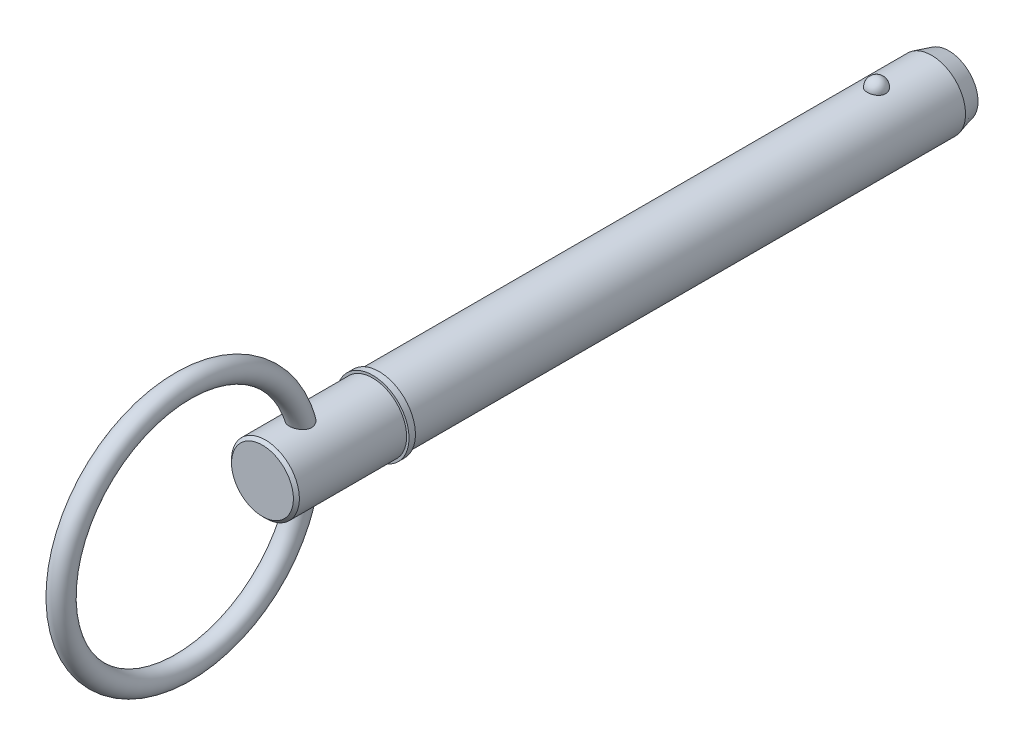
ISO-10303-21;
HEADER;
FILE_DESCRIPTION(('STEP AP214'),'2;1');
FILE_NAME('part.step','',(''),(''),'','','');
FILE_SCHEMA(('AUTOMOTIVE_DESIGN { 1 0 10303 214 1 1 1 1 }'));
ENDSEC;
DATA;
#1=APPLICATION_CONTEXT('core data for automotive mechanical design processes');
#2=APPLICATION_PROTOCOL_DEFINITION('international standard','automotive_design',2000,#1);
#3=PRODUCT_CONTEXT('',#1,'mechanical');
#4=PRODUCT('Part','Part','',(#3));
#5=PRODUCT_RELATED_PRODUCT_CATEGORY('part','',(#4));
#6=PRODUCT_DEFINITION_FORMATION('','',#4);
#7=PRODUCT_DEFINITION_CONTEXT('part definition',#1,'design');
#8=PRODUCT_DEFINITION('design','',#6,#7);
#9=PRODUCT_DEFINITION_SHAPE('','',#8);
#10=(LENGTH_UNIT() NAMED_UNIT(*) SI_UNIT(.MILLI.,.METRE.));
#11=(NAMED_UNIT(*) PLANE_ANGLE_UNIT() SI_UNIT($,.RADIAN.));
#12=(NAMED_UNIT(*) SI_UNIT($,.STERADIAN.) SOLID_ANGLE_UNIT());
#13=UNCERTAINTY_MEASURE_WITH_UNIT(LENGTH_MEASURE(1.E-05),#10,'distance_accuracy_value','');
#14=(GEOMETRIC_REPRESENTATION_CONTEXT(3) GLOBAL_UNCERTAINTY_ASSIGNED_CONTEXT((#13)) GLOBAL_UNIT_ASSIGNED_CONTEXT((#10,
#11,#12)) REPRESENTATION_CONTEXT('',''));
#15=CARTESIAN_POINT('',(0.,0.,0.));
#16=DIRECTION('',(0.,0.,1.));
#17=DIRECTION('',(1.,0.,0.));
#18=AXIS2_PLACEMENT_3D('',#15,#16,#17);
#19=CARTESIAN_POINT('',(0.,0.,114.3));
#20=DIRECTION('',(0.,0.,-1.));
#21=DIRECTION('',(-1.,0.,0.));
#22=AXIS2_PLACEMENT_3D('',#19,#20,#21);
#23=CYLINDRICAL_SURFACE('',#22,7.94);
#24=CARTESIAN_POINT('',(2.13020349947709,7.64891057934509,-2.14999999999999));
#25=CARTESIAN_POINT('',(2.1302012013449,7.64891247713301,-2.02978166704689));
#26=CARTESIAN_POINT('',(2.12037546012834,7.65166842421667,-1.90953383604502));
#27=CARTESIAN_POINT('',(2.08130792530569,7.66238579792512,-1.67243962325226));
#28=CARTESIAN_POINT('',(2.05205785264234,7.67034944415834,-1.55559471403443));
#29=CARTESIAN_POINT('',(1.97489181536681,7.69057749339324,-1.32869361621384));
#30=CARTESIAN_POINT('',(1.92698409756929,7.70283999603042,-1.21863445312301));
#31=CARTESIAN_POINT('',(1.81370645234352,7.73029430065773,-1.00831338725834));
#32=CARTESIAN_POINT('',(1.74833715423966,7.7454859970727,-0.908051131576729));
#33=CARTESIAN_POINT('',(1.60144242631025,7.77718699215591,-0.719628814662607));
#34=CARTESIAN_POINT('',(1.51984382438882,7.7937020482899,-0.631526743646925));
#35=CARTESIAN_POINT('',(1.34279837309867,7.82614685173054,-0.470411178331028));
#36=CARTESIAN_POINT('',(1.24735148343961,7.84207659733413,-0.397397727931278));
#37=CARTESIAN_POINT('',(1.04544839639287,7.87153116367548,-0.268681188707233));
#38=CARTESIAN_POINT('',(0.939022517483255,7.88506234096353,-0.212932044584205));
#39=CARTESIAN_POINT('',(0.717931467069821,7.90825597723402,-0.120080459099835));
#40=CARTESIAN_POINT('',(0.603267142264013,7.9179188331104,-0.0829761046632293));
#41=CARTESIAN_POINT('',(0.371015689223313,7.93216561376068,-0.0289596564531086));
#42=CARTESIAN_POINT('',(0.253510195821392,7.93683225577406,-0.0117183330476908));
#43=CARTESIAN_POINT('',(0.0171784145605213,7.94086051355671,0.00318921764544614));
#44=CARTESIAN_POINT('',(-0.101647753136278,7.94022260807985,0.000857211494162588));
#45=CARTESIAN_POINT('',(-0.335567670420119,7.93375751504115,-0.023146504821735));
#46=CARTESIAN_POINT('',(-0.450690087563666,7.92799987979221,-0.0445590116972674));
#47=CARTESIAN_POINT('',(-0.675610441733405,7.91200792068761,-0.10576054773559));
#48=CARTESIAN_POINT('',(-0.785408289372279,7.90177352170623,-0.145549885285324));
#49=CARTESIAN_POINT('',(-0.9972706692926,7.87784802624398,-0.242675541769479));
#50=CARTESIAN_POINT('',(-1.0992893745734,7.86413823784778,-0.300107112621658));
#51=CARTESIAN_POINT('',(-1.29223659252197,7.83474718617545,-0.430887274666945));
#52=CARTESIAN_POINT('',(-1.38316404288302,7.81906573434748,-0.504237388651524));
#53=CARTESIAN_POINT('',(-1.55313516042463,7.78710451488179,-0.666358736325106));
#54=CARTESIAN_POINT('',(-1.63193689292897,7.77081906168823,-0.755382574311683));
#55=CARTESIAN_POINT('',(-1.77366356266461,7.73970270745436,-0.945507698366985));
#56=CARTESIAN_POINT('',(-1.83658745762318,7.72487190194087,-1.04660977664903));
#57=CARTESIAN_POINT('',(-1.94556640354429,7.6981535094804,-1.25927689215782));
#58=CARTESIAN_POINT('',(-1.99143480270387,7.6862989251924,-1.3709418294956));
#59=CARTESIAN_POINT('',(-2.06418311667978,7.66708387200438,-1.60066153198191));
#60=CARTESIAN_POINT('',(-2.0910635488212,7.65972328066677,-1.71871612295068));
#61=CARTESIAN_POINT('',(-2.12508507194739,7.65035479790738,-1.9573607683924));
#62=CARTESIAN_POINT('',(-2.13230490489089,7.64832555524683,-2.07793875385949));
#63=CARTESIAN_POINT('',(-2.12704767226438,7.64978921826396,-2.31862835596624));
#64=CARTESIAN_POINT('',(-2.1145710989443,7.6532819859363,-2.43873998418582));
#65=CARTESIAN_POINT('',(-2.07034166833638,7.66536368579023,-2.67451689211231));
#66=CARTESIAN_POINT('',(-2.03867758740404,7.67392914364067,-2.79020005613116));
#67=CARTESIAN_POINT('',(-1.95694065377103,7.69517736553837,-3.01446692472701));
#68=CARTESIAN_POINT('',(-1.90686710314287,7.70786028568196,-3.12305035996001));
#69=CARTESIAN_POINT('',(-1.78925555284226,7.73600831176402,-3.33065971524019));
#70=CARTESIAN_POINT('',(-1.72162904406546,7.75148739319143,-3.42963360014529));
#71=CARTESIAN_POINT('',(-1.57074739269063,7.78346215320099,-3.61466914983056));
#72=CARTESIAN_POINT('',(-1.48749169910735,7.79995786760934,-3.70073035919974));
#73=CARTESIAN_POINT('',(-1.30720250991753,7.83219119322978,-3.8578359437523));
#74=CARTESIAN_POINT('',(-1.2101234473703,7.84792605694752,-3.92882863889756));
#75=CARTESIAN_POINT('',(-1.00503150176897,7.87681523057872,-4.05342383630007));
#76=CARTESIAN_POINT('',(-0.897019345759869,7.88996971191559,-4.10702749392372));
#77=CARTESIAN_POINT('',(-0.674439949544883,7.91208451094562,-4.19477736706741));
#78=CARTESIAN_POINT('',(-0.55996501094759,7.92109245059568,-4.22914554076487));
#79=CARTESIAN_POINT('',(-0.326625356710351,7.93413878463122,-4.27838865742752));
#80=CARTESIAN_POINT('',(-0.20776113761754,7.93817773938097,-4.29326579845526));
#81=CARTESIAN_POINT('',(0.0287357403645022,7.94081322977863,-4.3030062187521));
#82=CARTESIAN_POINT('',(0.14635312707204,7.93950453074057,-4.29821797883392));
#83=CARTESIAN_POINT('',(0.379062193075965,7.93180098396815,-4.26955229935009));
#84=CARTESIAN_POINT('',(0.494153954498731,7.92540630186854,-4.24567548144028));
#85=CARTESIAN_POINT('',(0.718185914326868,7.90824874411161,-4.17962260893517));
#86=CARTESIAN_POINT('',(0.827145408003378,7.89750055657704,-4.13750805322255));
#87=CARTESIAN_POINT('',(1.03638036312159,7.87277755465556,-4.03615078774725));
#88=CARTESIAN_POINT('',(1.13665531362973,7.85880255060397,-3.97690707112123));
#89=CARTESIAN_POINT('',(1.32729731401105,7.82887859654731,-3.84189297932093));
#90=CARTESIAN_POINT('',(1.41749828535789,7.81290379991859,-3.76589388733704));
#91=CARTESIAN_POINT('',(1.58397257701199,7.78086330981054,-3.59992466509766));
#92=CARTESIAN_POINT('',(1.66024342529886,7.76479760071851,-3.50995206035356));
#93=CARTESIAN_POINT('',(1.79805631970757,7.73405928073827,-3.3168832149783));
#94=CARTESIAN_POINT('',(1.85933944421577,7.719413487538,-3.213597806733));
#95=CARTESIAN_POINT('',(1.96397499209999,7.69345992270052,-2.99796163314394));
#96=CARTESIAN_POINT('',(2.00733488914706,7.68215076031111,-2.88561466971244));
#97=CARTESIAN_POINT('',(2.07068045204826,7.66529896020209,-2.6699413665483));
#98=CARTESIAN_POINT('',(2.09296296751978,7.65919990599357,-2.56732606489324));
#99=CARTESIAN_POINT('',(2.12272535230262,7.65100492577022,-2.35981463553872));
#100=CARTESIAN_POINT('',(2.13020550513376,7.64890892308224,-2.25491855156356));
#101=CARTESIAN_POINT('',(2.13020349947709,7.64891057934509,-2.14999999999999));
#102=B_SPLINE_CURVE_WITH_KNOTS('',3,(#24,#25,#26,#27,#28,#29,#30,#31,#32,#33,#34,#35,#36,#37,
#38,#39,#40,#41,#42,#43,#44,#45,#46,#47,#48,#49,#50,#51,#52,#53,#54,#55,#56,#57,#58,#59,#60,#61,
#62,#63,#64,#65,#66,#67,#68,#69,#70,#71,#72,#73,#74,#75,#76,#77,#78,#79,#80,#81,#82,#83,#84,#85,
#86,#87,#88,#89,#90,#91,#92,#93,#94,#95,#96,#97,#98,#99,#100,#101),.UNSPECIFIED.,.T.,.F.,(4,2,2,
2,2,2,2,2,2,2,2,2,2,2,2,2,2,2,2,2,2,2,2,2,2,2,2,2,2,2,2,2,2,2,2,2,2,2,4),(0.,0.360277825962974,
0.720709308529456,1.0809816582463,1.44124102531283,1.80316307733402,2.16508618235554,
2.52603531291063,2.88694740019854,3.24178717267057,3.59659491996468,3.94665496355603,
4.29672088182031,4.64871108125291,5.0007349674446,5.3590619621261,5.71741247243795,
6.079576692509,6.44173104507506,6.80243279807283,7.16312553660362,7.52216203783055,
7.88121215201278,8.24210915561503,8.60301888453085,8.96514709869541,9.32725124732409,
9.68508606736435,10.0428805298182,10.3943622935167,10.7458326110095,11.0961268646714,
11.4464417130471,11.8018724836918,12.1573662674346,12.5186252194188,12.8797333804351,
13.1941658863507,13.5085923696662),.UNSPECIFIED.);
#103=CARTESIAN_POINT('',(2.13020349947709,7.64891057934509,-2.14999999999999));
#104=VERTEX_POINT('',#103);
#105=EDGE_CURVE('E102',#104,#104,#102,.T.);
#106=ORIENTED_EDGE('',*,*,#105,.T.);
#107=EDGE_LOOP('',(#106));
#108=FACE_BOUND('',#107,.T.);
#109=CARTESIAN_POINT('',(0.,0.,-15.0499999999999));
#110=DIRECTION('',(0.,0.,-1.));
#111=DIRECTION('',(-1.,0.,0.));
#112=AXIS2_PLACEMENT_3D('',#109,#110,#111);
#113=CIRCLE('',#112,7.94);
#114=CARTESIAN_POINT('',(-7.94,0.,-15.0499999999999));
#115=VERTEX_POINT('',#114);
#116=EDGE_CURVE('E110',#115,#115,#113,.F.);
#117=ORIENTED_EDGE('',*,*,#116,.T.);
#118=EDGE_LOOP('',(#117));
#119=FACE_BOUND('',#118,.T.);
#120=CARTESIAN_POINT('',(0.,0.,114.3));
#121=DIRECTION('',(0.,0.,1.));
#122=DIRECTION('',(1.,0.,0.));
#123=AXIS2_PLACEMENT_3D('',#120,#121,#122);
#124=CIRCLE('',#123,7.94);
#125=CARTESIAN_POINT('',(7.94,0.,114.3));
#126=VERTEX_POINT('',#125);
#127=EDGE_CURVE('E108',#126,#126,#124,.T.);
#128=ORIENTED_EDGE('',*,*,#127,.F.);
#129=EDGE_LOOP('',(#128));
#130=FACE_BOUND('',#129,.T.);
#131=ADVANCED_FACE('F39',(#108,#119,#130),#23,.T.);
#132=CARTESIAN_POINT('',(0.,0.,-19.05));
#133=DIRECTION('',(0.,0.,-1.));
#134=DIRECTION('',(-1.,0.,0.));
#135=AXIS2_PLACEMENT_3D('',#132,#133,#134);
#136=PLANE('',#135);
#137=CARTESIAN_POINT('',(0.,0.,-19.05));
#138=DIRECTION('',(0.,0.,-1.));
#139=DIRECTION('',(-1.,0.,0.));
#140=AXIS2_PLACEMENT_3D('',#137,#138,#139);
#141=CIRCLE('',#140,6.86820323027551);
#142=CARTESIAN_POINT('',(-6.86820323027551,0.,-19.05));
#143=VERTEX_POINT('',#142);
#144=EDGE_CURVE('E143',#143,#143,#141,.T.);
#145=ORIENTED_EDGE('',*,*,#144,.T.);
#146=EDGE_LOOP('',(#145));
#147=FACE_BOUND('',#146,.T.);
#148=ADVANCED_FACE('F88',(#147),#136,.T.);
#149=CARTESIAN_POINT('',(0.,0.,-19.05));
#150=DIRECTION('',(0.,0.,1.));
#151=DIRECTION('',(1.,0.,0.));
#152=AXIS2_PLACEMENT_3D('',#149,#150,#151);
#153=CONICAL_SURFACE('',#152,6.86820323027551,0.261799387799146);
#154=ORIENTED_EDGE('',*,*,#116,.F.);
#155=EDGE_LOOP('',(#154));
#156=FACE_BOUND('',#155,.T.);
#157=ORIENTED_EDGE('',*,*,#144,.F.);
#158=EDGE_LOOP('',(#157));
#159=FACE_BOUND('',#158,.T.);
#160=ADVANCED_FACE('F94',(#156,#159),#153,.T.);
#161=CARTESIAN_POINT('',(0.,7.94,-2.14999999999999));
#162=DIRECTION('',(0.,1.,0.));
#163=DIRECTION('',(0.,0.,1.));
#164=AXIS2_PLACEMENT_3D('',#161,#162,#163);
#165=SPHERICAL_SURFACE('',#164,2.15);
#166=ORIENTED_EDGE('',*,*,#105,.F.);
#167=EDGE_LOOP('',(#166));
#168=FACE_BOUND('',#167,.T.);
#169=ADVANCED_FACE('F113',(#168),#165,.T.);
#170=CARTESIAN_POINT('',(0.,0.,114.3));
#171=DIRECTION('',(0.,0.,-1.));
#172=DIRECTION('',(-1.,0.,0.));
#173=AXIS2_PLACEMENT_3D('',#170,#171,#172);
#174=PLANE('',#173);
#175=ORIENTED_EDGE('',*,*,#127,.T.);
#176=EDGE_LOOP('',(#175));
#177=FACE_BOUND('',#176,.T.);
#178=CARTESIAN_POINT('',(0.,0.,114.3));
#179=DIRECTION('',(0.,0.,-1.));
#180=DIRECTION('',(-1.,0.,0.));
#181=AXIS2_PLACEMENT_3D('',#178,#179,#180);
#182=CIRCLE('',#181,8.5);
#183=CARTESIAN_POINT('',(-8.5,0.,114.3));
#184=VERTEX_POINT('',#183);
#185=EDGE_CURVE('E109',#184,#184,#182,.T.);
#186=ORIENTED_EDGE('',*,*,#185,.T.);
#187=EDGE_LOOP('',(#186));
#188=FACE_BOUND('',#187,.T.);
#189=ADVANCED_FACE('F117',(#177,#188),#174,.T.);
#190=CARTESIAN_POINT('',(0.,0.,33.7287874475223));
#191=DIRECTION('',(0.,0.,-1.));
#192=DIRECTION('',(-1.,0.,0.));
#193=AXIS2_PLACEMENT_3D('',#190,#191,#192);
#194=CYLINDRICAL_SURFACE('',#193,8.5);
#195=CARTESIAN_POINT('',(0.,0.,115.8));
#196=DIRECTION('',(0.,0.,-1.));
#197=DIRECTION('',(-1.,0.,0.));
#198=AXIS2_PLACEMENT_3D('',#195,#196,#197);
#199=CIRCLE('',#198,8.5);
#200=CARTESIAN_POINT('',(-8.5,0.,115.8));
#201=VERTEX_POINT('',#200);
#202=EDGE_CURVE('E134',#201,#201,#199,.T.);
#203=ORIENTED_EDGE('',*,*,#202,.T.);
#204=EDGE_LOOP('',(#203));
#205=FACE_BOUND('',#204,.T.);
#206=ORIENTED_EDGE('',*,*,#185,.F.);
#207=EDGE_LOOP('',(#206));
#208=FACE_BOUND('',#207,.T.);
#209=ADVANCED_FACE('F121',(#205,#208),#194,.T.);
#210=CARTESIAN_POINT('',(0.,8.5,115.8));
#211=DIRECTION('',(0.,0.,1.));
#212=DIRECTION('',(1.,0.,0.));
#213=AXIS2_PLACEMENT_3D('',#210,#211,#212);
#214=PLANE('',#213);
#215=CARTESIAN_POINT('',(0.,0.,115.8));
#216=DIRECTION('',(0.,0.,1.));
#217=DIRECTION('',(1.,0.,0.));
#218=AXIS2_PLACEMENT_3D('',#215,#216,#217);
#219=CIRCLE('',#218,7.94);
#220=CARTESIAN_POINT('',(7.94,0.,115.8));
#221=VERTEX_POINT('',#220);
#222=EDGE_CURVE('E112',#221,#221,#219,.T.);
#223=ORIENTED_EDGE('',*,*,#222,.F.);
#224=EDGE_LOOP('',(#223));
#225=FACE_BOUND('',#224,.T.);
#226=ORIENTED_EDGE('',*,*,#202,.F.);
#227=EDGE_LOOP('',(#226));
#228=FACE_BOUND('',#227,.T.);
#229=ADVANCED_FACE('F85',(#225,#228),#214,.T.);
#230=CARTESIAN_POINT('',(0.,0.,141.61));
#231=DIRECTION('',(0.,0.,-1.));
#232=DIRECTION('',(-1.,0.,0.));
#233=AXIS2_PLACEMENT_3D('',#230,#231,#232);
#234=CYLINDRICAL_SURFACE('',#233,7.94);
#235=CARTESIAN_POINT('',(-1.15544091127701,-7.85547938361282,130.411910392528));
#236=CARTESIAN_POINT('',(-1.03089695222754,-7.87379554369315,130.349615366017));
#237=CARTESIAN_POINT('',(-0.900845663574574,-7.8898743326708,130.297593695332));
#238=CARTESIAN_POINT('',(-0.63341751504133,-7.91583465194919,130.215265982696));
#239=CARTESIAN_POINT('',(-0.496037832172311,-7.92571377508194,130.184968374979));
#240=CARTESIAN_POINT('',(-0.217881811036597,-7.93823020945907,130.146773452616));
#241=CARTESIAN_POINT('',(-0.0771057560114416,-7.94086812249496,130.138874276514));
#242=CARTESIAN_POINT('',(0.203828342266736,-7.93862624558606,130.145648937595));
#243=CARTESIAN_POINT('',(0.34398643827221,-7.93374711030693,130.160320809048));
#244=CARTESIAN_POINT('',(0.619544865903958,-7.9169944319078,130.211877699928));
#245=CARTESIAN_POINT('',(0.754950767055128,-7.9051293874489,130.248735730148));
#246=CARTESIAN_POINT('',(1.0173752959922,-7.8756583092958,130.343842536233));
#247=CARTESIAN_POINT('',(1.14439334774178,-7.85805188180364,130.402092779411));
#248=CARTESIAN_POINT('',(1.38668443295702,-7.81893907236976,130.538842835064));
#249=CARTESIAN_POINT('',(1.50193494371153,-7.79742542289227,130.617380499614));
#250=CARTESIAN_POINT('',(1.71711272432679,-7.75288428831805,130.792872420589));
#251=CARTESIAN_POINT('',(1.81704089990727,-7.72985689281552,130.889825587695));
#252=CARTESIAN_POINT('',(1.99787261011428,-7.68509802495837,131.09887149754));
#253=CARTESIAN_POINT('',(2.07893183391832,-7.66335713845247,131.210827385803));
#254=CARTESIAN_POINT('',(2.22076589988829,-7.62346723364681,131.447480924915));
#255=CARTESIAN_POINT('',(2.28154607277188,-7.6053172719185,131.572175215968));
#256=CARTESIAN_POINT('',(2.38011540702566,-7.57504217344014,131.827618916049));
#257=CARTESIAN_POINT('',(2.41840843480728,-7.56278621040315,131.958158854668));
#258=CARTESIAN_POINT('',(2.47363993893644,-7.54490265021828,132.224095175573));
#259=CARTESIAN_POINT('',(2.49057788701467,-7.53927521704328,132.359491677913));
#260=CARTESIAN_POINT('',(2.50351014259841,-7.53499042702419,132.63242871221));
#261=CARTESIAN_POINT('',(2.49933630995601,-7.53638902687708,132.769977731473));
#262=CARTESIAN_POINT('',(2.47072547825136,-7.54581524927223,133.042698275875));
#263=CARTESIAN_POINT('',(2.44628184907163,-7.55384504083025,133.177869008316));
#264=CARTESIAN_POINT('',(2.37589315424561,-7.57629160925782,133.453085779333));
#265=CARTESIAN_POINT('',(2.32844094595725,-7.5911515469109,133.59270896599));
#266=CARTESIAN_POINT('',(2.21332780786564,-7.62550828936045,133.862781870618));
#267=CARTESIAN_POINT('',(2.14565489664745,-7.64500784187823,133.993226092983));
#268=CARTESIAN_POINT('',(1.98438755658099,-7.68852412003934,134.253702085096));
#269=CARTESIAN_POINT('',(1.88896913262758,-7.71279219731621,134.382569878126));
#270=CARTESIAN_POINT('',(1.67743245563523,-7.76154719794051,134.622112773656));
#271=CARTESIAN_POINT('',(1.56130644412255,-7.78603420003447,134.732781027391));
#272=CARTESIAN_POINT('',(1.31168281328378,-7.83191501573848,134.930100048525));
#273=CARTESIAN_POINT('',(1.17841631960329,-7.85334315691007,135.017029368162));
#274=CARTESIAN_POINT('',(0.967442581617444,-7.88116219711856,135.126657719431));
#275=CARTESIAN_POINT('',(0.895283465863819,-7.88971376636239,135.159736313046));
#276=CARTESIAN_POINT('',(0.747777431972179,-7.90505596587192,135.218400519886));
#277=CARTESIAN_POINT('',(0.672431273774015,-7.91184701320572,135.243987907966));
#278=CARTESIAN_POINT('',(0.530575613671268,-7.92252382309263,135.283912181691));
#279=CARTESIAN_POINT('',(0.464394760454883,-7.92668987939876,135.299349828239));
#280=CARTESIAN_POINT('',(0.330815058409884,-7.9333870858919,135.324069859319));
#281=CARTESIAN_POINT('',(0.263416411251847,-7.93591850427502,135.33335325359));
#282=CARTESIAN_POINT('',(0.128041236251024,-7.93925585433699,135.345577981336));
#283=CARTESIAN_POINT('',(0.0600650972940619,-7.94006286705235,135.348523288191));
#284=CARTESIAN_POINT('',(-0.0758408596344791,-7.93992929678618,135.348033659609));
#285=CARTESIAN_POINT('',(-0.143770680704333,-7.93898884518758,135.344599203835));
#286=CARTESIAN_POINT('',(-0.330023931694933,-7.93402174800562,135.326406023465));
#287=CARTESIAN_POINT('',(-0.44772081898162,-7.92820264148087,135.305060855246));
#288=CARTESIAN_POINT('',(-0.677833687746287,-7.91185818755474,135.244093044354));
#289=CARTESIAN_POINT('',(-0.790248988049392,-7.90133223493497,135.204468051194));
#290=CARTESIAN_POINT('',(-1.01082100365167,-7.8762011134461,135.107436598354));
#291=CARTESIAN_POINT('',(-1.11873674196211,-7.86147932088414,135.049515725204));
#292=CARTESIAN_POINT('',(-1.32464461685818,-7.8294189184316,134.918755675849));
#293=CARTESIAN_POINT('',(-1.42263264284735,-7.81207923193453,134.845910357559));
#294=CARTESIAN_POINT('',(-1.62038324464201,-7.77363945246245,134.676536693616));
#295=CARTESIAN_POINT('',(-1.71849387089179,-7.75235190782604,134.578123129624));
#296=CARTESIAN_POINT('',(-1.89908721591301,-7.71010284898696,134.367783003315));
#297=CARTESIAN_POINT('',(-1.98155871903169,-7.68914157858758,134.255846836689));
#298=CARTESIAN_POINT('',(-2.13974270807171,-7.64674394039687,134.005108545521));
#299=CARTESIAN_POINT('',(-2.21304020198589,-7.62562536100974,133.864719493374));
#300=CARTESIAN_POINT('',(-2.33615659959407,-7.58881542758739,133.573266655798));
#301=CARTESIAN_POINT('',(-2.38596943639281,-7.57312547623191,133.422200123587));
#302=CARTESIAN_POINT('',(-2.46059473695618,-7.54921618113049,133.110492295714));
#303=CARTESIAN_POINT('',(-2.48494918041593,-7.54113395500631,132.949728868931));
#304=CARTESIAN_POINT('',(-2.50480773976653,-7.53456588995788,132.626244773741));
#305=CARTESIAN_POINT('',(-2.50033692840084,-7.53607171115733,132.463525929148));
#306=CARTESIAN_POINT('',(-2.46306926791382,-7.54832452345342,132.157165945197));
#307=CARTESIAN_POINT('',(-2.43295696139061,-7.55819528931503,132.013162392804));
#308=CARTESIAN_POINT('',(-2.34806892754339,-7.58499431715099,131.733304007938));
#309=CARTESIAN_POINT('',(-2.29330013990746,-7.60192059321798,131.597446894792));
#310=CARTESIAN_POINT('',(-2.16523724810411,-7.63933506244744,131.34765733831));
#311=CARTESIAN_POINT('',(-2.09353456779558,-7.65948502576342,131.232853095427));
#312=CARTESIAN_POINT('',(-1.93200913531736,-7.7018104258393,131.017268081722));
#313=CARTESIAN_POINT('',(-1.842192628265,-7.72398516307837,130.916482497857));
#314=CARTESIAN_POINT('',(-1.65746337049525,-7.76558957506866,130.74131484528));
#315=CARTESIAN_POINT('',(-1.56413624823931,-7.78505810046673,130.665259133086));
#316=CARTESIAN_POINT('',(-1.36706423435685,-7.82207051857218,130.52753576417));
#317=CARTESIAN_POINT('',(-1.26331856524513,-7.83961426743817,130.465869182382));
#318=CARTESIAN_POINT('',(-1.15544091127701,-7.85547938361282,130.411910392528));
#319=B_SPLINE_CURVE_WITH_KNOTS('',3,(#235,#236,#237,#238,#239,#240,#241,#242,#243,#244,#245,
#246,#247,#248,#249,#250,#251,#252,#253,#254,#255,#256,#257,#258,#259,#260,#261,#262,#263,#264,
#265,#266,#267,#268,#269,#270,#271,#272,#273,#274,#275,#276,#277,#278,#279,#280,#281,#282,#283,
#284,#285,#286,#287,#288,#289,#290,#291,#292,#293,#294,#295,#296,#297,#298,#299,#300,#301,#302,
#303,#304,#305,#306,#307,#308,#309,#310,#311,#312,#313,#314,#315,#316,#317,#318),.UNSPECIFIED.,
.T.,.F.,(4,2,2,2,2,2,2,2,2,2,2,2,2,2,2,2,2,2,2,2,2,2,2,2,2,2,2,2,2,2,2,2,2,2,2,2,2,2,2,2,2,4),
(0.,0.420927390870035,0.842018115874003,1.26307384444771,1.68409290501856,2.10460083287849,
2.52513760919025,2.94646475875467,3.36776699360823,3.78545897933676,4.20304108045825,
4.61086922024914,5.01870744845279,5.42979890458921,5.84102487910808,6.28383316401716,
6.72690434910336,7.21113455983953,7.69554657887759,8.17400305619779,8.41316278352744,
8.65226580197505,8.85622998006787,9.06016068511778,9.26396350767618,9.4677510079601,
9.82521046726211,10.1827159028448,10.5513335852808,10.9201032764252,11.3402098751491,
11.7606166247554,12.2377707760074,12.715048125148,13.2007716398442,13.6860727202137,
14.1260485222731,14.5659005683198,14.9745225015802,15.3830037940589,15.7475760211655,
16.1121754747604),.UNSPECIFIED.);
#320=CARTESIAN_POINT('',(-1.15544091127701,-7.85547938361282,130.411910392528));
#321=VERTEX_POINT('',#320);
#322=EDGE_CURVE('E10',#321,#321,#319,.T.);
#323=ORIENTED_EDGE('',*,*,#322,.F.);
#324=EDGE_LOOP('',(#323));
#325=FACE_BOUND('',#324,.T.);
#326=CARTESIAN_POINT('',(-1.15544091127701,7.85547938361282,130.411910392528));
#327=CARTESIAN_POINT('',(-1.278579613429,7.83736699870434,130.473507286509));
#328=CARTESIAN_POINT('',(-1.39638360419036,7.8170599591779,130.545172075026));
#329=CARTESIAN_POINT('',(-1.61803025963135,7.77421032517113,130.70708252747));
#330=CARTESIAN_POINT('',(-1.72186951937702,7.7516671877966,130.797332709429));
#331=CARTESIAN_POINT('',(-1.9126968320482,7.70680387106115,130.994395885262));
#332=CARTESIAN_POINT('',(-1.99967065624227,7.68448389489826,131.101222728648));
#333=CARTESIAN_POINT('',(-2.15412555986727,7.64262858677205,131.328607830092));
#334=CARTESIAN_POINT('',(-2.2216118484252,7.62309251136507,131.449162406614));
#335=CARTESIAN_POINT('',(-2.3342927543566,7.5893410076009,131.698377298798));
#336=CARTESIAN_POINT('',(-2.37985628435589,7.57503857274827,131.826859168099));
#337=CARTESIAN_POINT('',(-2.44955571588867,7.55278941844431,132.090011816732));
#338=CARTESIAN_POINT('',(-2.47369226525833,7.544842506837,132.22468240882));
#339=CARTESIAN_POINT('',(-2.50059611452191,7.53596831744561,132.496137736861));
#340=CARTESIAN_POINT('',(-2.50339277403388,7.53503139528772,132.632919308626));
#341=CARTESIAN_POINT('',(-2.48855779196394,7.53994222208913,132.905224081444));
#342=CARTESIAN_POINT('',(-2.47092012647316,7.54579197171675,133.04074689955));
#343=CARTESIAN_POINT('',(-2.41469361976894,7.56397908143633,133.316293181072));
#344=CARTESIAN_POINT('',(-2.37479606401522,7.57671999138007,133.456021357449));
#345=CARTESIAN_POINT('',(-2.27489955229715,7.60730881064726,133.727515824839));
#346=CARTESIAN_POINT('',(-2.2148900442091,7.6251594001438,133.859277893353));
#347=CARTESIAN_POINT('',(-2.06943931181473,7.66598084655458,134.12452508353));
#348=CARTESIAN_POINT('',(-1.98208275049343,7.68928197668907,134.256914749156));
#349=CARTESIAN_POINT('',(-1.78658869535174,7.73704343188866,134.505235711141));
#350=CARTESIAN_POINT('',(-1.67843905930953,7.76150442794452,134.621157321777));
#351=CARTESIAN_POINT('',(-1.44142605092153,7.80900750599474,134.833699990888));
#352=CARTESIAN_POINT('',(-1.31231821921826,7.83202775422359,134.930058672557));
#353=CARTESIAN_POINT('',(-1.10627655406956,7.86286215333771,135.054614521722));
#354=CARTESIAN_POINT('',(-1.03552563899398,7.87252500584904,135.092805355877));
#355=CARTESIAN_POINT('',(-0.890375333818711,7.89025728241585,135.161885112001));
#356=CARTESIAN_POINT('',(-0.815978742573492,7.89832790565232,135.192779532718));
#357=CARTESIAN_POINT('',(-0.674180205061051,7.91160332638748,135.243082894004));
#358=CARTESIAN_POINT('',(-0.607145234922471,7.91704543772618,135.263468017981));
#359=CARTESIAN_POINT('',(-0.471385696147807,7.92628663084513,135.297876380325));
#360=CARTESIAN_POINT('',(-0.402662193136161,7.93008672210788,135.311903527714));
#361=CARTESIAN_POINT('',(-0.26415304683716,7.9359070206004,135.333322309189));
#362=CARTESIAN_POINT('',(-0.194368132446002,7.9379283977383,135.340718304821));
#363=CARTESIAN_POINT('',(-0.0544054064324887,7.940122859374,135.348743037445));
#364=CARTESIAN_POINT('',(0.0157723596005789,7.94029615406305,135.349372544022));
#365=CARTESIAN_POINT('',(0.206295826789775,7.93822912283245,135.341825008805));
#366=CARTESIAN_POINT('',(0.326425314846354,7.93416340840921,135.326989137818));
#367=CARTESIAN_POINT('',(0.562310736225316,7.92094769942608,135.278077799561));
#368=CARTESIAN_POINT('',(0.678066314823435,7.91179729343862,135.24400077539));
#369=CARTESIAN_POINT('',(0.903029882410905,7.88929555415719,135.158269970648));
#370=CARTESIAN_POINT('',(1.01220356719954,7.87592415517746,135.106532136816));
#371=CARTESIAN_POINT('',(1.22142047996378,7.84620431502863,134.987793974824));
#372=CARTESIAN_POINT('',(1.32146048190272,7.82985482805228,134.920788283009));
#373=CARTESIAN_POINT('',(1.52328754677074,7.7932678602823,134.764309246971));
#374=CARTESIAN_POINT('',(1.6236508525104,7.77280069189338,134.673056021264));
#375=CARTESIAN_POINT('',(1.80985117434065,7.73156849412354,134.476815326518));
#376=CARTESIAN_POINT('',(1.895678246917,7.71080327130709,134.37181854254));
#377=CARTESIAN_POINT('',(2.06302404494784,7.66785771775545,134.134543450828));
#378=CARTESIAN_POINT('',(2.1421317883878,7.64590590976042,134.000514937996));
#379=CARTESIAN_POINT('',(2.27825755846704,7.60645646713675,133.720994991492));
#380=CARTESIAN_POINT('',(2.33526577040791,7.58896081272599,133.575498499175));
#381=CARTESIAN_POINT('',(2.42707573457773,7.56011538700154,133.270242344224));
#382=CARTESIAN_POINT('',(2.46084599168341,7.54905411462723,133.110140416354));
#383=CARTESIAN_POINT('',(2.49980168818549,7.53624914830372,132.786129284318));
#384=CARTESIAN_POINT('',(2.50500938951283,7.5344981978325,132.622223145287));
#385=CARTESIAN_POINT('',(2.48594104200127,7.54080673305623,132.309976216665));
#386=CARTESIAN_POINT('',(2.46407777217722,7.54806351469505,132.161473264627));
#387=CARTESIAN_POINT('',(2.3945479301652,7.57040718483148,131.871258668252));
#388=CARTESIAN_POINT('',(2.34689355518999,7.58549037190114,131.729543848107));
#389=CARTESIAN_POINT('',(2.23182745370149,7.62009243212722,131.469141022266));
#390=CARTESIAN_POINT('',(2.16637710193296,7.63914093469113,131.349517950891));
#391=CARTESIAN_POINT('',(2.01638736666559,7.6800914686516,131.12346099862));
#392=CARTESIAN_POINT('',(1.93184850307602,7.70199342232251,131.017026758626));
#393=CARTESIAN_POINT('',(1.74664202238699,7.74608439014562,130.82066977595));
#394=CARTESIAN_POINT('',(1.646079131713,7.76827073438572,130.73064744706));
#395=CARTESIAN_POINT('',(1.43119791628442,7.81071401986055,130.568308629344));
#396=CARTESIAN_POINT('',(1.31687846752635,7.83097080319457,130.495993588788));
#397=CARTESIAN_POINT('',(1.07477437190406,7.86789551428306,130.369149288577));
#398=CARTESIAN_POINT('',(0.946739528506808,7.88446964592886,130.315069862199));
#399=CARTESIAN_POINT('',(0.683029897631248,7.91167708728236,130.228213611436));
#400=CARTESIAN_POINT('',(0.547354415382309,7.92230985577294,130.195438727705));
#401=CARTESIAN_POINT('',(0.271066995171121,7.93658630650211,130.151730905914));
#402=CARTESIAN_POINT('',(0.130424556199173,7.94017418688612,130.140972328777));
#403=CARTESIAN_POINT('',(-0.150736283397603,7.93981282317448,130.142062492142));
#404=CARTESIAN_POINT('',(-0.291254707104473,7.93586558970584,130.153905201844));
#405=CARTESIAN_POINT('',(-0.556023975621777,7.92151946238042,130.197891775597));
#406=CARTESIAN_POINT('',(-0.68062174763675,7.91171585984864,130.228166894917));
#407=CARTESIAN_POINT('',(-0.923476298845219,7.88705844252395,130.306736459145));
#408=CARTESIAN_POINT('',(-1.04173303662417,7.87220459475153,130.355031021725));
#409=CARTESIAN_POINT('',(-1.15544091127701,7.85547938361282,130.411910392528));
#410=B_SPLINE_CURVE_WITH_KNOTS('',3,(#326,#327,#328,#329,#330,#331,#332,#333,#334,#335,#336,
#337,#338,#339,#340,#341,#342,#343,#344,#345,#346,#347,#348,#349,#350,#351,#352,#353,#354,#355,
#356,#357,#358,#359,#360,#361,#362,#363,#364,#365,#366,#367,#368,#369,#370,#371,#372,#373,#374,
#375,#376,#377,#378,#379,#380,#381,#382,#383,#384,#385,#386,#387,#388,#389,#390,#391,#392,#393,
#394,#395,#396,#397,#398,#399,#400,#401,#402,#403,#404,#405,#406,#407,#408,#409),.UNSPECIFIED.,
.T.,.F.,(4,2,2,2,2,2,2,2,2,2,2,2,2,2,2,2,2,2,2,2,2,2,2,2,2,2,2,2,2,2,2,2,2,2,2,2,2,2,2,2,2,4),
(0.,0.416167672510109,0.83243663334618,1.2490552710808,1.66556244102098,2.07479168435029,
2.48400855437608,2.89266231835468,3.30143658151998,3.7372506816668,4.17329379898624,
4.6520487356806,5.13108409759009,5.61617224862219,5.85876072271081,6.10116578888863,
6.31168904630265,6.52208269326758,6.7323378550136,6.94256910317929,7.30398888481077,
7.66543791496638,8.02863174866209,8.39195337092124,8.801906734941,9.21213940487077,
9.68159903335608,10.1512669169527,10.6406305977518,11.1296128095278,11.5779838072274,
12.0261429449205,12.4372146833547,12.8482752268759,13.256751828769,13.6652618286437,
14.0832160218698,14.5012082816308,14.9224982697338,15.3436758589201,15.72796797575,
16.1122626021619),.UNSPECIFIED.);
#411=CARTESIAN_POINT('',(-1.15544091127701,7.85547938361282,130.411910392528));
#412=VERTEX_POINT('',#411);
#413=EDGE_CURVE('E51',#412,#412,#410,.T.);
#414=ORIENTED_EDGE('',*,*,#413,.F.);
#415=EDGE_LOOP('',(#414));
#416=FACE_BOUND('',#415,.T.);
#417=CARTESIAN_POINT('',(0.,0.,140.91));
#418=DIRECTION('',(0.,0.,-1.));
#419=DIRECTION('',(-1.,0.,0.));
#420=AXIS2_PLACEMENT_3D('',#417,#418,#419);
#421=CIRCLE('',#420,7.94);
#422=CARTESIAN_POINT('',(-7.94,0.,140.91));
#423=VERTEX_POINT('',#422);
#424=EDGE_CURVE('E64',#423,#423,#421,.T.);
#425=ORIENTED_EDGE('',*,*,#424,.T.);
#426=EDGE_LOOP('',(#425));
#427=FACE_BOUND('',#426,.T.);
#428=ORIENTED_EDGE('',*,*,#222,.T.);
#429=EDGE_LOOP('',(#428));
#430=FACE_BOUND('',#429,.T.);
#431=ADVANCED_FACE('F69',(#325,#416,#427,#430),#234,.T.);
#432=CARTESIAN_POINT('',(0.,0.,141.61));
#433=DIRECTION('',(0.,0.,-1.));
#434=DIRECTION('',(-1.,0.,0.));
#435=AXIS2_PLACEMENT_3D('',#432,#433,#434);
#436=PLANE('',#435);
#437=CARTESIAN_POINT('',(0.,0.,141.61));
#438=DIRECTION('',(0.,0.,-1.));
#439=DIRECTION('',(-1.,0.,0.));
#440=AXIS2_PLACEMENT_3D('',#437,#438,#439);
#441=CIRCLE('',#440,7.24);
#442=CARTESIAN_POINT('',(-7.24,0.,141.61));
#443=VERTEX_POINT('',#442);
#444=EDGE_CURVE('E58',#443,#443,#441,.F.);
#445=ORIENTED_EDGE('',*,*,#444,.T.);
#446=EDGE_LOOP('',(#445));
#447=FACE_BOUND('',#446,.T.);
#448=ADVANCED_FACE('F76',(#447),#436,.F.);
#449=CARTESIAN_POINT('',(0.,0.,140.91));
#450=DIRECTION('',(0.,0.,-1.));
#451=DIRECTION('',(-1.,0.,0.));
#452=AXIS2_PLACEMENT_3D('',#449,#450,#451);
#453=CONICAL_SURFACE('',#452,7.94,0.785398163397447);
#454=ORIENTED_EDGE('',*,*,#444,.F.);
#455=EDGE_LOOP('',(#454));
#456=FACE_BOUND('',#455,.T.);
#457=ORIENTED_EDGE('',*,*,#424,.F.);
#458=EDGE_LOOP('',(#457));
#459=FACE_BOUND('',#458,.T.);
#460=ADVANCED_FACE('F41',(#456,#459),#453,.T.);
#461=CARTESIAN_POINT('',(0.,0.,160.185));
#462=DIRECTION('',(1.,0.,0.));
#463=DIRECTION('',(0.,0.,-1.));
#464=AXIS2_PLACEMENT_3D('',#461,#462,#463);
#465=TOROIDAL_SURFACE('',#464,28.575,2.5);
#466=ORIENTED_EDGE('',*,*,#322,.T.);
#467=EDGE_LOOP('',(#466));
#468=FACE_BOUND('',#467,.T.);
#469=ORIENTED_EDGE('',*,*,#413,.T.);
#470=EDGE_LOOP('',(#469));
#471=FACE_BOUND('',#470,.T.);
#472=ADVANCED_FACE('F73',(#468,#471),#465,.T.);
#473=CLOSED_SHELL('',(#131,#148,#160,#169,#189,#209,#229,#431,#448,#460,#472));
#474=MANIFOLD_SOLID_BREP('B2',#473);
#475=ADVANCED_BREP_SHAPE_REPRESENTATION('',(#18,#474),#14);
#476=SHAPE_DEFINITION_REPRESENTATION(#9,#475);
ENDSEC;
END-ISO-10303-21;
